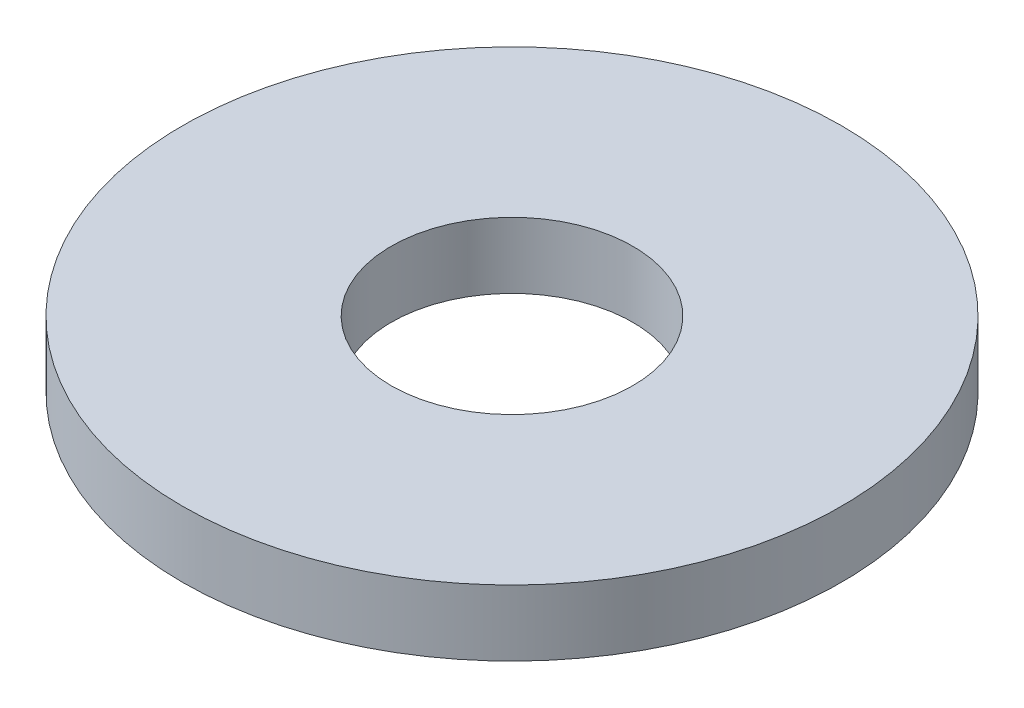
from build123d import *

# Parameters (mm, degrees)
SKETCH1_R      = 1.5
SKETCH1_R_2    = 0.55
EXTRUDE1_DEPTH = 0.3


with BuildPart() as part:
    # Sketch1 → Extrude1 (new body)
    with BuildSketch(Plane(origin=(0, 0, 0), x_dir=(1, 0, 0), z_dir=(0, 1, 0))):
        with Locations(Location((0, 0, 0), (0, 0, 270))):
            Circle(SKETCH1_R)
        with Locations(Location((0, 0, 0), (0, 0, 270))):
            Circle(SKETCH1_R_2, mode=Mode.SUBTRACT)
    extrude(amount=EXTRUDE1_DEPTH)


solid = part.part
